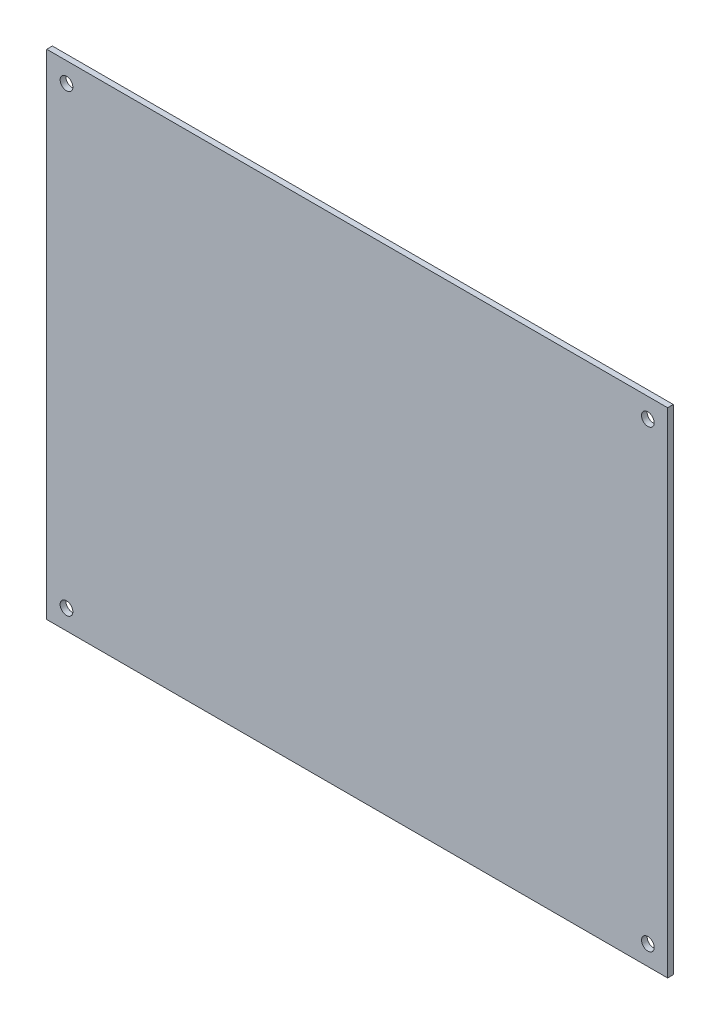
from build123d import *

# Parameters (mm, degrees)
SKETCH1_W           = 220
SKETCH1_H           = 175
BOSS_EXTRUDE1_DEPTH = 2
SKETCH2_R           = 2.25
CUT_EXTRUDE1_DEPTH  = 282.120970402


with BuildPart() as part:
    # Sketch1 → Boss-Extrude1 (new body)
    with BuildSketch(Plane.XY):
        with Locations((110, 87.5)):
            Rectangle(SKETCH1_W, SKETCH1_H)
    extrude(amount=BOSS_EXTRUDE1_DEPTH)

    # Sketch2 → Cut-Extrude1 (cut, through all)
    with BuildSketch(Plane.XY.offset(2)):
        with Locations((7, 168)):
            Circle(SKETCH2_R)
        with Locations((213, 168)):
            Circle(SKETCH2_R)
        with Locations((213, 7)):
            Circle(SKETCH2_R)
        with Locations((7, 7)):
            Circle(SKETCH2_R)
    extrude(amount=-CUT_EXTRUDE1_DEPTH, mode=Mode.SUBTRACT)


solid = part.part
